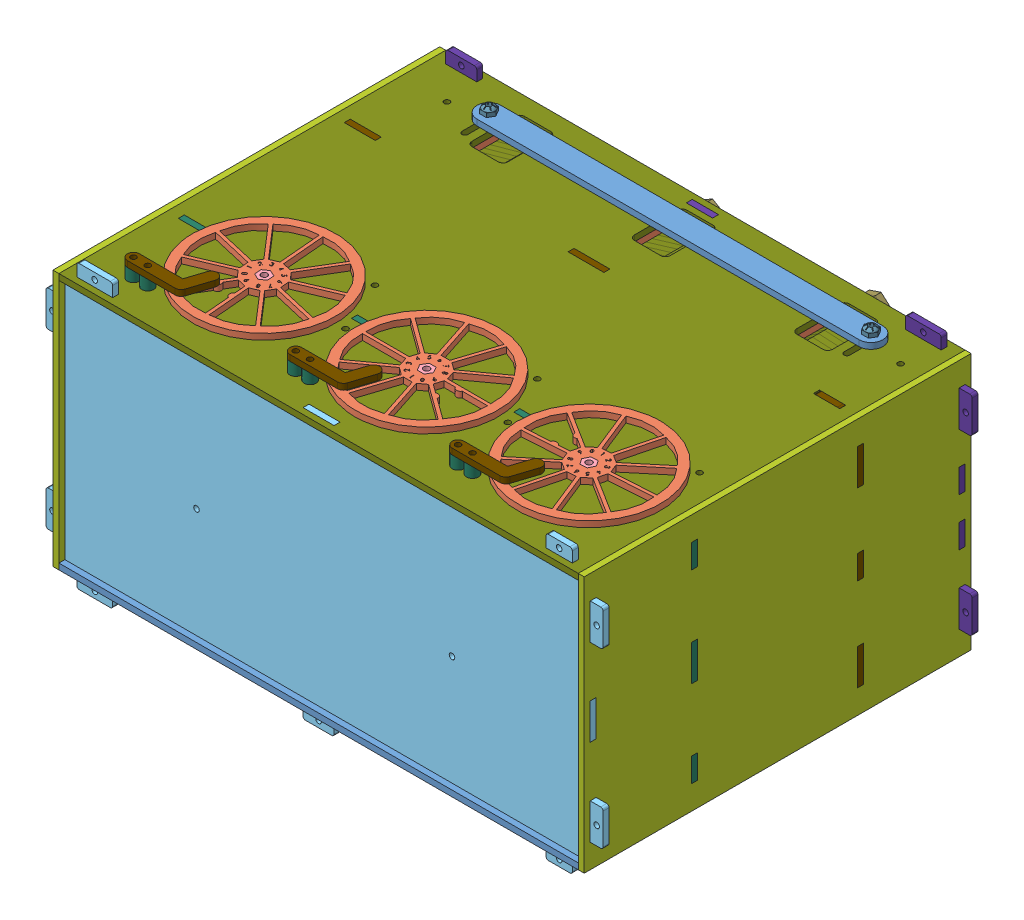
SolidWorks assembly Pascaline.SLDASM, configuration Default (file format 7000). Lengths in mm.
Overall size (316.89 316.89 291.18).
280 component instances, 43 part files, 61 mates.
Components (placement in the parent):
- BottomPanel-1: BottomPanel.SLDPRT [Default] at (-116.7085 3.175 3.175) x (1 0 0) z (0 0 -1) size (276.23 3.17 205.74)
- Input-1: Input.SLDASM [Default] at (-58.2885 162.7052 -47.625) x (0.085321 0 0.996353) z (-0.996353 0 0.085321) size (76.2 73.03 76.2)
  - InputWheel-1: InputWheel.SLDPRT [Default] at (0 -26.1802 0) size (76.2 3.17 76.2)
  - AccumulatorGear-1: AccumulatorGear.SLDPRT [input] at (0 -73.8052 0) size (69.85 3.17 69.85)
  - Standoff-2in-1s4-1: Standoff-2in-1s4.SLDPRT [Default] at (0 -73.8052 0) size (7.33 50.8 6.35)
  - Screw-4-40-1in-1: Screw-4-40-1in.SLDPRT [Default] at (-28.575 -96.0302 9.2846) size (2.84 25.4 2.84)
  - Screw-4-40-1in-2: Screw-4-40-1in.SLDPRT [Default] at (-17.6603 -96.0302 24.3073) size (2.84 25.4 2.84)
  - Screw-4-40-1in-3: Screw-4-40-1in.SLDPRT [Default] at (-28.575 -96.0302 -9.2846) size (2.84 25.4 2.84)
- Accumulator-1: Accumulator.SLDASM [Default] at (-34.3564 65.4099 -52.0636) x (0.406714 -0.913555 0.00082) z (-0.913553 -0.406711 0.002734) size (76.79 111.93 76.84)
  - AccumulatorGear-3: AccumulatorGear.SLDPRT [accum] at (5.3261 -33.8708 28.4877) x (0.104553 -0.002805 0.994515) z (-0.994519 0.00053 0.104555) size (69.85 3.17 69.85)
  - AccumulatorGear-4: AccumulatorGear.SLDPRT [accum] at (5.3078 -56.0957 28.4269) x (0.104553 -0.002805 0.994515) z (-0.994519 0.00053 0.104555) size (69.85 3.17 69.85)
  - Screw-4-40-1in-1: Screw-4-40-1in.SLDPRT [Default] at (-24.534 -8.455 31.6985) x (0.998773 -0.000684 -0.049509) z (-0.049507 0.002771 -0.99877) size (2.84 25.4 2.84)
  - Screw-4-40-1in-2: Screw-4-40-1in.SLDPRT [Default] at (-20.6737 -8.4085 13.5351) x (0.998773 -0.000684 -0.049509) z (-0.049507 0.002771 -0.99877) size (2.84 25.4 2.84)
  - Screw-4-40-1in-3: Screw-4-40-1in.SLDPRT [Default] at (-16.9808 -8.5076 48.662) x (0.998773 -0.000684 -0.049509) z (-0.049507 0.002771 -0.99877) size (2.84 25.4 2.84)
  - Screw-4-40-1in-4: Screw-4-40-1in.SLDPRT [Default] at (-24.5704 -52.9048 31.577) x (0.998773 -0.000684 -0.049509) z (-0.049507 0.002771 -0.99877) size (2.84 25.4 2.84)
  - Screw-4-40-1in-5: Screw-4-40-1in.SLDPRT [Default] at (-17.0381 -78.3573 48.4711) x (-0.902967 0.001916 -0.429705) z (0.429708 0.002116 -0.902965) size (2.84 25.4 2.84)
  - Screw-4-40-1in-6: Screw-4-40-1in.SLDPRT [Default] at (-20.7101 -52.8583 13.4136) x (0.998773 -0.000684 -0.049509) z (-0.049507 0.002771 -0.99877) size (2.84 25.4 2.84)
  - OutputGear-1: OutputGear.SLDPRT [Default] at (5.2689 -103.5935 28.297) x (0.104553 -0.002805 0.994515) z (-0.994519 0.00053 0.104555) size (50.8 3.17 50.8)
  - Standoff-4in-1s4-2: Standoff-4in-1s4.SLDPRT [Default] at (5.2689 -103.5935 28.297) x (0.104553 -0.002805 0.994515) z (-0.994519 0.00053 0.104555) size (7.33 101.6 6.35)
  - Screw-4-40-0p5in-1: Screw-4-40-0p5in.SLDPRT [Default] at (-14.6072 -113.1079 30.3598) x (1 -0.00082 -0.000001) z (-0.000001 -0.002734 0.999996) size (2.84 12.7 2.84)
  - Screw-4-40-0p5in-2: Screw-4-40-0p5in.SLDPRT [Default] at (-9.585 -113.1428 41.6391) x (1 -0.00082 -0.000001) z (-0.000001 -0.002734 0.999996) size (2.84 12.7 2.84)
  - Screw-4-40-0p5in-3: Screw-4-40-0p5in.SLDPRT [Default] at (-12.0405 -113.077 18.2826) x (1 -0.00082 -0.000001) z (-0.000001 -0.002734 0.999996) size (2.84 12.7 2.84)
  - Standoff-p75in-1s4-1: Standoff-p75in-1s4.SLDPRT [Default] at (20.7376 -33.8528 17.29) x (1 -0.00082 -0.000001) z (-0.00082 -0.999996 -0.002734) size (6.35 6.35 19.05)
  - Standoff-p75in-1s4-2: Standoff-p75in-1s4.SLDPRT [Default] at (-12.0772 -33.8353 20.7398) x (0.984615 -0.00033 -0.174737) z (-0.00082 -0.999996 -0.002734) size (6.35 6.35 19.05)
  - OutputGearCap-1: OutputGearCap.SLDPRT [Default] at (5.2663 -106.7685 28.2884) x (0.104553 -0.002805 0.994515) z (-0.994519 0.00053 0.104555) size (21.59 3.17 21.59)
  - Washer-0p38in-1: Washer-0p38in.SLDPRT [Default] at (5.3522 -1.9939 28.5748) x (0.863042 0.000673 -0.505132) z (0.00082 0.999996 0.002734) size (9.65 9.65 0.76)
  - Spacer-stack-8-1: Spacer-stack-8.SLDASM [Default] at (-3.9241 -38.1647 21.5198) x (0.104553 -0.002805 0.994515) z (0.00082 0.999996 0.002734) size (13.2 11.43 25.4)
    - Spacer-hex-1s4-1: Spacer-hex-1s4.SLDPRT [Default] at (7.8847 8.4687 7.4956) size (13.2 11.43 3.17)
    - Spacer-hex-1s4-2: Spacer-hex-1s4.SLDPRT [Default] at (7.8847 8.4687 10.6706) size (13.2 11.43 3.17)
    - Spacer-hex-1s4-3: Spacer-hex-1s4.SLDPRT [Default] at (7.8847 8.4687 13.8456) size (13.2 11.43 3.17)
    - Spacer-hex-1s4-4: Spacer-hex-1s4.SLDPRT [Default] at (7.8847 8.4687 17.0206) size (13.2 11.43 3.17)
    - Spacer-hex-1s4-5: Spacer-hex-1s4.SLDPRT [Default] at (7.8847 8.4687 20.1956) size (13.2 11.43 3.17)
    - Spacer-hex-1s4-6: Spacer-hex-1s4.SLDPRT [Default] at (7.8847 8.4687 23.3706) size (13.2 11.43 3.17)
    - Spacer-hex-1s4-7: Spacer-hex-1s4.SLDPRT [Default] at (7.8847 8.4687 26.5456) size (13.2 11.43 3.17)
    - Spacer-hex-1s4-8: Spacer-hex-1s4.SLDPRT [Default] at (7.8847 8.4687 29.7206) size (13.2 11.43 3.17)
- Readout-1: Readout.SLDASM [Default] at (14.1171 39.2986 -199.7504) x (0.941933 0.3358 0) z (0 0 1) size (85.24 81.6 65.02)
  - Standoff-2p5in-1s4-3: Standoff-2p5in-1s4.SLDPRT [Default] at (-51.5451 71.035 -5.9896) x (0.829038 -0.559193 0) z (-0.559193 -0.829038 0) size (7.33 63.5 6.35)
  - ReadoutGear-1: ReadoutGear.SLDPRT [Default] at (-51.5451 71.035 38.7169) x (0.997564 -0.069756 0) z (0 0 1) size (49.17 51.37 3.17)
  - Spacer-0p25-1s4-4: Spacer-0p25-1s4.SLDPRT [Default] at (-59.1849 67.3088 32.3669) size (6.35 6.35 6.35)
  - Spacer-0p25-1s4-5: Spacer-0p25-1s4.SLDPRT [Default] at (-44.4983 66.2819 32.3669) size (6.35 6.35 6.35)
  - Spacer-0p25-1s4-6: Spacer-0p25-1s4.SLDPRT [Default] at (-50.9522 79.5143 32.3669) size (6.35 6.35 6.35)
  - ReadoutCylinder-1: ReadoutCylinder.SLDPRT [Default] at (-51.5451 71.035 29.1919) x (0.997564 -0.069756 0) z (0 0 1) size (80.12 76.2 3.17)
  - ReadoutCylinder-2: ReadoutCylinder.SLDPRT [Default] at (-51.5451 71.035 26.0169) x (0.997564 -0.069756 0) z (0 0 1) size (80.12 76.2 3.17)
  - ReadoutCylinder-3: ReadoutCylinder.SLDPRT [Default] at (-51.5451 71.035 22.8419) x (0.997564 -0.069756 0) z (0 0 1) size (80.12 76.2 3.17)
  - ReadoutCylinder-4: ReadoutCylinder.SLDPRT [Default] at (-51.5451 71.035 19.6669) x (0.997564 -0.069756 0) z (0 0 1) size (80.12 76.2 3.17)
  - ReadoutCylinder-5: ReadoutCylinder.SLDPRT [Default] at (-51.5451 71.035 16.4919) x (0.997564 -0.069756 0) z (0 0 1) size (80.12 76.2 3.17)
  - ReadoutCylinder-6: ReadoutCylinder.SLDPRT [Default] at (-51.5451 71.035 13.3169) x (0.997564 -0.069756 0) z (0 0 1) size (80.12 76.2 3.17)
  - ReadoutCylinder-7: ReadoutCylinder.SLDPRT [Default] at (-51.5451 71.035 10.1419) x (0.997564 -0.069756 0) z (0 0 1) size (80.12 76.2 3.17)
  - ReadoutCylinder-8: ReadoutCylinder.SLDPRT [Default] at (-51.5451 71.035 6.9669) x (0.997564 -0.069756 0) z (0 0 1) size (80.12 76.2 3.17)
  - Washer-0p38in-1: Washer-0p38in.SLDPRT [Default] at (-51.5451 71.035 57.5104) x (0.999237 0.039047 0) z (0 0 1) size (9.65 9.65 0.76)
  - Washer-0p38in-2: Washer-0p38in.SLDPRT [Default] at (-51.5451 71.035 -6.7516) size (9.65 9.65 0.76)
- Input-2: Input.SLDASM [Default] at (28.0715 162.7052 -47.625) size (76.2 73.03 76.2)
  - InputWheel-1: InputWheel.SLDPRT [Default] at (0 -26.1802 0) size (76.2 3.17 76.2)
  - AccumulatorGear-1: AccumulatorGear.SLDPRT [input] at (0 -73.8052 0) size (69.85 3.17 69.85)
  - Standoff-2in-1s4-1: Standoff-2in-1s4.SLDPRT [Default] at (0 -73.8052 0) size (7.33 50.8 6.35)
  - Screw-4-40-1in-1: Screw-4-40-1in.SLDPRT [Default] at (-28.575 -96.0302 9.2846) size (2.84 25.4 2.84)
  - Screw-4-40-1in-2: Screw-4-40-1in.SLDPRT [Default] at (-17.6603 -96.0302 24.3073) size (2.84 25.4 2.84)
  - Screw-4-40-1in-3: Screw-4-40-1in.SLDPRT [Default] at (-28.575 -96.0302 -9.2846) size (2.84 25.4 2.84)
- Accumulator-2: Accumulator.SLDASM [Default] at (31.6123 77.7559 -52.0636) x (0.953167 -0.302444 0.00082) z (-0.302445 -0.953163 0.002734) size (76.79 111.93 76.84)
  - AccumulatorGear-3: AccumulatorGear.SLDPRT [accum] at (5.3261 -33.8708 28.4877) x (0.104553 -0.002805 0.994515) z (-0.994519 0.00053 0.104555) size (69.85 3.17 69.85)
  - AccumulatorGear-4: AccumulatorGear.SLDPRT [accum] at (5.3078 -56.0957 28.4269) x (0.104553 -0.002805 0.994515) z (-0.994519 0.00053 0.104555) size (69.85 3.17 69.85)
  - Screw-4-40-1in-1: Screw-4-40-1in.SLDPRT [Default] at (-24.534 -8.455 31.6985) x (0.998773 -0.000684 -0.049509) z (-0.049507 0.002771 -0.99877) size (2.84 25.4 2.84)
  - Screw-4-40-1in-2: Screw-4-40-1in.SLDPRT [Default] at (-20.6737 -8.4085 13.5351) x (0.998773 -0.000684 -0.049509) z (-0.049507 0.002771 -0.99877) size (2.84 25.4 2.84)
  - Screw-4-40-1in-3: Screw-4-40-1in.SLDPRT [Default] at (-16.9808 -8.5076 48.662) x (0.998773 -0.000684 -0.049509) z (-0.049507 0.002771 -0.99877) size (2.84 25.4 2.84)
  - Screw-4-40-1in-4: Screw-4-40-1in.SLDPRT [Default] at (-24.5704 -52.9048 31.577) x (0.998773 -0.000684 -0.049509) z (-0.049507 0.002771 -0.99877) size (2.84 25.4 2.84)
  - Screw-4-40-1in-5: Screw-4-40-1in.SLDPRT [Default] at (-17.0381 -78.3573 48.4711) x (-0.902967 0.001916 -0.429705) z (0.429708 0.002116 -0.902965) size (2.84 25.4 2.84)
  - Screw-4-40-1in-6: Screw-4-40-1in.SLDPRT [Default] at (-20.7101 -52.8583 13.4136) x (0.998773 -0.000684 -0.049509) z (-0.049507 0.002771 -0.99877) size (2.84 25.4 2.84)
  - OutputGear-1: OutputGear.SLDPRT [Default] at (5.2689 -103.5935 28.297) x (0.104553 -0.002805 0.994515) z (-0.994519 0.00053 0.104555) size (50.8 3.17 50.8)
  - Standoff-4in-1s4-2: Standoff-4in-1s4.SLDPRT [Default] at (5.2689 -103.5935 28.297) x (0.104553 -0.002805 0.994515) z (-0.994519 0.00053 0.104555) size (7.33 101.6 6.35)
  - Screw-4-40-0p5in-1: Screw-4-40-0p5in.SLDPRT [Default] at (-14.6072 -113.1079 30.3598) x (1 -0.00082 -0.000001) z (-0.000001 -0.002734 0.999996) size (2.84 12.7 2.84)
  - Screw-4-40-0p5in-2: Screw-4-40-0p5in.SLDPRT [Default] at (-9.585 -113.1428 41.6391) x (1 -0.00082 -0.000001) z (-0.000001 -0.002734 0.999996) size (2.84 12.7 2.84)
  - Screw-4-40-0p5in-3: Screw-4-40-0p5in.SLDPRT [Default] at (-12.0405 -113.077 18.2826) x (1 -0.00082 -0.000001) z (-0.000001 -0.002734 0.999996) size (2.84 12.7 2.84)
  - Standoff-p75in-1s4-1: Standoff-p75in-1s4.SLDPRT [Default] at (20.7376 -33.8528 17.29) x (1 -0.00082 -0.000001) z (-0.00082 -0.999996 -0.002734) size (6.35 6.35 19.05)
  - Standoff-p75in-1s4-2: Standoff-p75in-1s4.SLDPRT [Default] at (-12.0772 -33.8353 20.7398) x (0.984615 -0.00033 -0.174737) z (-0.00082 -0.999996 -0.002734) size (6.35 6.35 19.05)
  - OutputGearCap-1: OutputGearCap.SLDPRT [Default] at (5.2663 -106.7685 28.2884) x (0.104553 -0.002805 0.994515) z (-0.994519 0.00053 0.104555) size (21.59 3.17 21.59)
  - Washer-0p38in-1: Washer-0p38in.SLDPRT [Default] at (5.3522 -1.9939 28.5748) x (0.863042 0.000673 -0.505132) z (0.00082 0.999996 0.002734) size (9.65 9.65 0.76)
  - Spacer-stack-8-1: Spacer-stack-8.SLDASM [Default] at (-3.9241 -38.1647 21.5198) x (0.104553 -0.002805 0.994515) z (0.00082 0.999996 0.002734) size (13.2 11.43 25.4)
    - Spacer-hex-1s4-1: Spacer-hex-1s4.SLDPRT [Default] at (7.8847 8.4687 7.4956) size (13.2 11.43 3.17)
    - Spacer-hex-1s4-2: Spacer-hex-1s4.SLDPRT [Default] at (7.8847 8.4687 10.6706) size (13.2 11.43 3.17)
    - Spacer-hex-1s4-3: Spacer-hex-1s4.SLDPRT [Default] at (7.8847 8.4687 13.8456) size (13.2 11.43 3.17)
    - Spacer-hex-1s4-4: Spacer-hex-1s4.SLDPRT [Default] at (7.8847 8.4687 17.0206) size (13.2 11.43 3.17)
    - Spacer-hex-1s4-5: Spacer-hex-1s4.SLDPRT [Default] at (7.8847 8.4687 20.1956) size (13.2 11.43 3.17)
    - Spacer-hex-1s4-6: Spacer-hex-1s4.SLDPRT [Default] at (7.8847 8.4687 23.3706) size (13.2 11.43 3.17)
    - Spacer-hex-1s4-7: Spacer-hex-1s4.SLDPRT [Default] at (7.8847 8.4687 26.5456) size (13.2 11.43 3.17)
    - Spacer-hex-1s4-8: Spacer-hex-1s4.SLDPRT [Default] at (7.8847 8.4687 29.7206) size (13.2 11.43 3.17)
- Readout-2: Readout.SLDASM [Default] at (59.1789 6.8317 -199.7504) x (0.964985 -0.262305 0) z (0 0 1) size (85.24 81.6 65.02)
  - Standoff-2p5in-1s4-3: Standoff-2p5in-1s4.SLDPRT [Default] at (-51.5451 71.035 -5.9896) x (0.829038 -0.559193 0) z (-0.559193 -0.829038 0) size (7.33 63.5 6.35)
  - ReadoutGear-1: ReadoutGear.SLDPRT [Default] at (-51.5451 71.035 38.7169) x (0.997564 -0.069756 0) z (0 0 1) size (49.17 51.37 3.17)
  - Spacer-0p25-1s4-4: Spacer-0p25-1s4.SLDPRT [Default] at (-59.1849 67.3088 32.3669) size (6.35 6.35 6.35)
  - Spacer-0p25-1s4-5: Spacer-0p25-1s4.SLDPRT [Default] at (-44.4983 66.2819 32.3669) size (6.35 6.35 6.35)
  - Spacer-0p25-1s4-6: Spacer-0p25-1s4.SLDPRT [Default] at (-50.9522 79.5143 32.3669) size (6.35 6.35 6.35)
  - ReadoutCylinder-1: ReadoutCylinder.SLDPRT [Default] at (-51.5451 71.035 29.1919) x (0.997564 -0.069756 0) z (0 0 1) size (80.12 76.2 3.17)
  - ReadoutCylinder-2: ReadoutCylinder.SLDPRT [Default] at (-51.5451 71.035 26.0169) x (0.997564 -0.069756 0) z (0 0 1) size (80.12 76.2 3.17)
  - ReadoutCylinder-3: ReadoutCylinder.SLDPRT [Default] at (-51.5451 71.035 22.8419) x (0.997564 -0.069756 0) z (0 0 1) size (80.12 76.2 3.17)
  - ReadoutCylinder-4: ReadoutCylinder.SLDPRT [Default] at (-51.5451 71.035 19.6669) x (0.997564 -0.069756 0) z (0 0 1) size (80.12 76.2 3.17)
  - ReadoutCylinder-5: ReadoutCylinder.SLDPRT [Default] at (-51.5451 71.035 16.4919) x (0.997564 -0.069756 0) z (0 0 1) size (80.12 76.2 3.17)
  - ReadoutCylinder-6: ReadoutCylinder.SLDPRT [Default] at (-51.5451 71.035 13.3169) x (0.997564 -0.069756 0) z (0 0 1) size (80.12 76.2 3.17)
  - ReadoutCylinder-7: ReadoutCylinder.SLDPRT [Default] at (-51.5451 71.035 10.1419) x (0.997564 -0.069756 0) z (0 0 1) size (80.12 76.2 3.17)
  - ReadoutCylinder-8: ReadoutCylinder.SLDPRT [Default] at (-51.5451 71.035 6.9669) x (0.997564 -0.069756 0) z (0 0 1) size (80.12 76.2 3.17)
  - Washer-0p38in-1: Washer-0p38in.SLDPRT [Default] at (-51.5451 71.035 57.5104) x (0.999237 0.039047 0) z (0 0 1) size (9.65 9.65 0.76)
  - Washer-0p38in-2: Washer-0p38in.SLDPRT [Default] at (-51.5451 71.035 -6.7516) size (9.65 9.65 0.76)
- Input-3: Input.SLDASM [Default] at (114.4315 162.7052 -47.625) x (-0.997759 0 0.066903) z (-0.066903 0 -0.997759) size (76.2 73.03 76.2)
  - InputWheel-1: InputWheel.SLDPRT [Default] at (0 -26.1802 0) size (76.2 3.17 76.2)
  - AccumulatorGear-1: AccumulatorGear.SLDPRT [input] at (0 -73.8052 0) size (69.85 3.17 69.85)
  - Standoff-2in-1s4-1: Standoff-2in-1s4.SLDPRT [Default] at (0 -73.8052 0) size (7.33 50.8 6.35)
  - Screw-4-40-1in-1: Screw-4-40-1in.SLDPRT [Default] at (-28.575 -96.0302 9.2846) size (2.84 25.4 2.84)
  - Screw-4-40-1in-2: Screw-4-40-1in.SLDPRT [Default] at (-17.6603 -96.0302 24.3073) size (2.84 25.4 2.84)
  - Screw-4-40-1in-3: Screw-4-40-1in.SLDPRT [Default] at (-28.575 -96.0302 -9.2846) size (2.84 25.4 2.84)
- Accumulator-4: Accumulator.SLDASM [Default] at (87.2292 38.6226 -52.0636) x (-0.17499 0.98457 0.00082) z (0.984567 0.174988 0.002734) size (76.79 111.93 76.84)
  - AccumulatorGear-3: AccumulatorGear.SLDPRT [accum] at (5.3261 -33.8708 28.4877) x (0.104553 -0.002805 0.994515) z (-0.994519 0.00053 0.104555) size (69.85 3.17 69.85)
  - AccumulatorGear-4: AccumulatorGear.SLDPRT [accum] at (5.3078 -56.0957 28.4269) x (0.104553 -0.002805 0.994515) z (-0.994519 0.00053 0.104555) size (69.85 3.17 69.85)
  - Screw-4-40-1in-1: Screw-4-40-1in.SLDPRT [Default] at (-24.534 -8.455 31.6985) x (0.998773 -0.000684 -0.049509) z (-0.049507 0.002771 -0.99877) size (2.84 25.4 2.84)
  - Screw-4-40-1in-2: Screw-4-40-1in.SLDPRT [Default] at (-20.6737 -8.4085 13.5351) x (0.998773 -0.000684 -0.049509) z (-0.049507 0.002771 -0.99877) size (2.84 25.4 2.84)
  - Screw-4-40-1in-3: Screw-4-40-1in.SLDPRT [Default] at (-16.9808 -8.5076 48.662) x (0.998773 -0.000684 -0.049509) z (-0.049507 0.002771 -0.99877) size (2.84 25.4 2.84)
  - Screw-4-40-1in-4: Screw-4-40-1in.SLDPRT [Default] at (-24.5704 -52.9048 31.577) x (0.998773 -0.000684 -0.049509) z (-0.049507 0.002771 -0.99877) size (2.84 25.4 2.84)
  - Screw-4-40-1in-5: Screw-4-40-1in.SLDPRT [Default] at (-17.0381 -78.3573 48.4711) x (-0.902967 0.001916 -0.429705) z (0.429708 0.002116 -0.902965) size (2.84 25.4 2.84)
  - Screw-4-40-1in-6: Screw-4-40-1in.SLDPRT [Default] at (-20.7101 -52.8583 13.4136) x (0.998773 -0.000684 -0.049509) z (-0.049507 0.002771 -0.99877) size (2.84 25.4 2.84)
  - OutputGear-1: OutputGear.SLDPRT [Default] at (5.2689 -103.5935 28.297) x (0.104553 -0.002805 0.994515) z (-0.994519 0.00053 0.104555) size (50.8 3.17 50.8)
  - Standoff-4in-1s4-2: Standoff-4in-1s4.SLDPRT [Default] at (5.2689 -103.5935 28.297) x (0.104553 -0.002805 0.994515) z (-0.994519 0.00053 0.104555) size (7.33 101.6 6.35)
  - Screw-4-40-0p5in-1: Screw-4-40-0p5in.SLDPRT [Default] at (-14.6072 -113.1079 30.3598) x (1 -0.00082 -0.000001) z (-0.000001 -0.002734 0.999996) size (2.84 12.7 2.84)
  - Screw-4-40-0p5in-2: Screw-4-40-0p5in.SLDPRT [Default] at (-9.585 -113.1428 41.6391) x (1 -0.00082 -0.000001) z (-0.000001 -0.002734 0.999996) size (2.84 12.7 2.84)
  - Screw-4-40-0p5in-3: Screw-4-40-0p5in.SLDPRT [Default] at (-12.0405 -113.077 18.2826) x (1 -0.00082 -0.000001) z (-0.000001 -0.002734 0.999996) size (2.84 12.7 2.84)
  - Standoff-p75in-1s4-1: Standoff-p75in-1s4.SLDPRT [Default] at (20.7376 -33.8528 17.29) x (1 -0.00082 -0.000001) z (-0.00082 -0.999996 -0.002734) size (6.35 6.35 19.05)
  - Standoff-p75in-1s4-2: Standoff-p75in-1s4.SLDPRT [Default] at (-12.0772 -33.8353 20.7398) x (0.984615 -0.00033 -0.174737) z (-0.00082 -0.999996 -0.002734) size (6.35 6.35 19.05)
  - OutputGearCap-1: OutputGearCap.SLDPRT [Default] at (5.2663 -106.7685 28.2884) x (0.104553 -0.002805 0.994515) z (-0.994519 0.00053 0.104555) size (21.59 3.17 21.59)
  - Washer-0p38in-1: Washer-0p38in.SLDPRT [Default] at (5.3522 -1.9939 28.5748) x (0.863042 0.000673 -0.505132) z (0.00082 0.999996 0.002734) size (9.65 9.65 0.76)
  - Spacer-stack-8-1: Spacer-stack-8.SLDASM [Default] at (-3.9241 -38.1647 21.5198) x (0.104553 -0.002805 0.994515) z (0.00082 0.999996 0.002734) size (13.2 11.43 25.4)
    - Spacer-hex-1s4-1: Spacer-hex-1s4.SLDPRT [Default] at (7.8847 8.4687 7.4956) size (13.2 11.43 3.17)
    - Spacer-hex-1s4-2: Spacer-hex-1s4.SLDPRT [Default] at (7.8847 8.4687 10.6706) size (13.2 11.43 3.17)
    - Spacer-hex-1s4-3: Spacer-hex-1s4.SLDPRT [Default] at (7.8847 8.4687 13.8456) size (13.2 11.43 3.17)
    - Spacer-hex-1s4-4: Spacer-hex-1s4.SLDPRT [Default] at (7.8847 8.4687 17.0206) size (13.2 11.43 3.17)
    - Spacer-hex-1s4-5: Spacer-hex-1s4.SLDPRT [Default] at (7.8847 8.4687 20.1956) size (13.2 11.43 3.17)
    - Spacer-hex-1s4-6: Spacer-hex-1s4.SLDPRT [Default] at (7.8847 8.4687 23.3706) size (13.2 11.43 3.17)
    - Spacer-hex-1s4-7: Spacer-hex-1s4.SLDPRT [Default] at (7.8847 8.4687 26.5456) size (13.2 11.43 3.17)
    - Spacer-hex-1s4-8: Spacer-hex-1s4.SLDPRT [Default] at (7.8847 8.4687 29.7206) size (13.2 11.43 3.17)
- Readout-3: Readout.SLDASM [Default] at (167.2561 18.8113 -199.7504) x (0.999836 0.018131 0) z (0 0 1) size (85.24 81.6 65.02)
  - Standoff-2p5in-1s4-3: Standoff-2p5in-1s4.SLDPRT [Default] at (-51.5451 71.035 -5.9896) x (0.829038 -0.559193 0) z (-0.559193 -0.829038 0) size (7.33 63.5 6.35)
  - ReadoutGear-1: ReadoutGear.SLDPRT [Default] at (-51.5451 71.035 38.7169) x (0.997564 -0.069756 0) z (0 0 1) size (49.17 51.37 3.17)
  - Spacer-0p25-1s4-4: Spacer-0p25-1s4.SLDPRT [Default] at (-59.1849 67.3088 32.3669) size (6.35 6.35 6.35)
  - Spacer-0p25-1s4-5: Spacer-0p25-1s4.SLDPRT [Default] at (-44.4983 66.2819 32.3669) size (6.35 6.35 6.35)
  - Spacer-0p25-1s4-6: Spacer-0p25-1s4.SLDPRT [Default] at (-50.9522 79.5143 32.3669) size (6.35 6.35 6.35)
  - ReadoutCylinder-1: ReadoutCylinder.SLDPRT [Default] at (-51.5451 71.035 29.1919) x (0.997564 -0.069756 0) z (0 0 1) size (80.12 76.2 3.17)
  - ReadoutCylinder-2: ReadoutCylinder.SLDPRT [Default] at (-51.5451 71.035 26.0169) x (0.997564 -0.069756 0) z (0 0 1) size (80.12 76.2 3.17)
  - ReadoutCylinder-3: ReadoutCylinder.SLDPRT [Default] at (-51.5451 71.035 22.8419) x (0.997564 -0.069756 0) z (0 0 1) size (80.12 76.2 3.17)
  - ReadoutCylinder-4: ReadoutCylinder.SLDPRT [Default] at (-51.5451 71.035 19.6669) x (0.997564 -0.069756 0) z (0 0 1) size (80.12 76.2 3.17)
  - ReadoutCylinder-5: ReadoutCylinder.SLDPRT [Default] at (-51.5451 71.035 16.4919) x (0.997564 -0.069756 0) z (0 0 1) size (80.12 76.2 3.17)
  - ReadoutCylinder-6: ReadoutCylinder.SLDPRT [Default] at (-51.5451 71.035 13.3169) x (0.997564 -0.069756 0) z (0 0 1) size (80.12 76.2 3.17)
  - ReadoutCylinder-7: ReadoutCylinder.SLDPRT [Default] at (-51.5451 71.035 10.1419) x (0.997564 -0.069756 0) z (0 0 1) size (80.12 76.2 3.17)
  - ReadoutCylinder-8: ReadoutCylinder.SLDPRT [Default] at (-51.5451 71.035 6.9669) x (0.997564 -0.069756 0) z (0 0 1) size (80.12 76.2 3.17)
  - Washer-0p38in-1: Washer-0p38in.SLDPRT [Default] at (-51.5451 71.035 57.5104) x (0.999237 0.039047 0) z (0 0 1) size (9.65 9.65 0.76)
  - Washer-0p38in-2: Washer-0p38in.SLDPRT [Default] at (-51.5451 71.035 -6.7516) size (9.65 9.65 0.76)
- BackPanel-1: BackPanel.SLDPRT [Default] at (-116.7085 3.175 -199.39) size (296.29 150.24 3.18)
- Ratchets-1: Ratchets.SLDASM [Default] at (-81.708 -156.4494 -388.6538) x (0.938568 0.345094 0) z (0 0 1) size (314.7 232.09 30.1)
  - MidPanel2-1: MidPanel2.SLDPRT [Default] at (22.2351 161.8968 243.2388) x (0.938568 -0.345094 0) z (0 0 1) size (282.58 143.38 3.18)
  - Standoff-0p75in-1s4-2: Standoff-0p75in-1s4.SLDPRT [Default] at (71.4078 258.8325 265.4638) x (-0.999902 -0.013974 0) z (0.013974 -0.999902 0) size (7.33 19.05 6.35)
  - Washer-0p38in-4: Washer-0p38in.SLDPRT [Default] at (71.4078 258.8325 265.4638) x (0.886945 0.461875 0) z (0 0 1) size (9.65 9.65 0.76)
  - Spacer-0p25-1s4-1: Spacer-0p25-1s4.SLDPRT [Default] at (71.4078 258.8325 266.2258) x (0.918268 0.39596 0) z (0 0 1) size (6.35 6.35 6.35)
  - Washer-0p38in-1: Washer-0p38in.SLDPRT [Default] at (71.4078 258.8325 272.5758) x (0.974797 -0.223092 0) z (0 0 1) size (9.65 9.65 0.76)
  - Standoff-0p75in-1s4-1: Standoff-0p75in-1s4.SLDPRT [Default] at (152.4626 229.0302 265.4638) x (-0.830154 -0.557534 0) z (0.557534 -0.830154 0) size (7.33 19.05 6.35)
  - Washer-0p38in-5: Washer-0p38in.SLDPRT [Default] at (152.4626 229.0302 265.4638) x (0.971362 -0.237603 0) z (0 0 1) size (9.65 9.65 0.76)
  - Spacer-0p25-1s4-2: Spacer-0p25-1s4.SLDPRT [Default] at (152.4626 229.0302 266.2258) x (0.998153 0.060744 0) z (0 0 1) size (6.35 6.35 6.35)
  - Washer-0p38in-2: Washer-0p38in.SLDPRT [Default] at (152.4626 229.0302 272.5758) x (0.964442 -0.264293 0) z (0 0 1) size (9.65 9.65 0.76)
  - Standoff-0p75in-1s4-3: Standoff-0p75in-1s4.SLDPRT [Default] at (233.5173 199.2278 265.4638) x (0.732123 -0.681172 0) z (0.681172 0.732123 0) size (7.33 19.05 6.35)
  - Washer-0p38in-6: Washer-0p38in.SLDPRT [Default] at (233.5173 199.2278 265.4638) x (0.998962 0.045555 0) z (0 0 1) size (9.65 9.65 0.76)
  - Spacer-0p25-1s4-3: Spacer-0p25-1s4.SLDPRT [Default] at (233.5173 199.2278 266.2258) x (-0.1226 0.992456 0) z (0 0 1) size (6.35 6.35 6.35)
  - Washer-0p38in-3: Washer-0p38in.SLDPRT [Default] at (233.5173 199.2278 272.5758) x (0.76285 -0.646575 0) z (0 0 1) size (9.65 9.65 0.76)
  - Standoff-round-0p25in-1s4-3: Standoff-round-0p25in-1s4.SLDPRT [Default] at (133.7739 148.7604 246.4138) x (-0.853855 0.520511 0) z (0 0 1) size (6.35 6.35 6.35)
  - Standoff-round-0p25in-1s4-4: Standoff-round-0p25in-1s4.SLDPRT [Default] at (214.8286 118.958 246.4138) x (-0.853855 0.520511 0) z (0 0 1) size (6.35 6.35 6.35)
  - SautoirBacking-2: SautoirBacking.SLDPRT [Default] at (77.1723 171.4661 252.7638) x (0.938568 -0.345094 0) z (0 0 1) size (20.32 35.56 3.17)
  - Spacer-0p25-1s4-4: Spacer-0p25-1s4.SLDPRT [Default] at (97.8841 198.3555 246.4138) size (6.35 6.35 6.35)
  - Spacer-0p25-1s4-5: Spacer-0p25-1s4.SLDPRT [Default] at (87.8039 170.9399 246.4138) size (6.35 6.35 6.35)
  - SautoirBacking-3: SautoirBacking.SLDPRT [Default] at (158.2271 141.6638 252.7638) x (0.938568 -0.345094 0) z (0 0 1) size (20.32 35.56 3.17)
  - Spacer-0p25-1s4-6: Spacer-0p25-1s4.SLDPRT [Default] at (168.8586 141.1376 246.4138) size (6.35 6.35 6.35)
  - Spacer-0p25-1s4-7: Spacer-0p25-1s4.SLDPRT [Default] at (178.9388 168.5531 246.4138) x (-0.849972 -0.526827 0) z (0 0 1) size (6.35 6.35 6.35)
- Backstop-1: Backstop.SLDASM [Default] at (-120.8445 61.946 -194.8362) x (0.991787 -0.127902 0) z (0 0 1) size (69.7 32.28 14.68)
  - BackstopPawl-1: BackstopPawl.SLDPRT [Default] at (4.0576 45.8485 75.5832) size (69.7 32.28 3.18)
  - BackstopPawl-2: BackstopPawl.SLDPRT [Default] at (4.0576 45.8485 72.4082) size (69.7 32.28 3.18)
  - Nut-3s8-1: Nut-3s8.SLDPRT [Default] at (57.7688 59.5119 70.4238) x (0 0 1) z (0 -1 0) size (8.33 14.29 16.5)
  - BackstopCap-1: BackstopCap.SLDPRT [Default] at (57.7688 59.5119 67.2488) x (0.989802 0.142448 0) z (0 0 1) size (15.88 15.88 3.17)
  - BackstopCap-2: BackstopCap.SLDPRT [Default] at (57.7688 59.5119 78.7582) x (0.999963 -0.008552 0) z (0 0 1) size (15.88 15.88 3.17)
- Backstop-2: Backstop.SLDASM [Default] at (-36.6112 62.7262 -194.8362) x (0.985272 -0.170992 0) z (0 0 1) size (69.7 32.28 14.68)
  - BackstopPawl-1: BackstopPawl.SLDPRT [Default] at (4.0576 45.8485 75.5832) size (69.7 32.28 3.18)
  - BackstopPawl-2: BackstopPawl.SLDPRT [Default] at (4.0576 45.8485 72.4082) size (69.7 32.28 3.18)
  - Nut-3s8-1: Nut-3s8.SLDPRT [Default] at (57.7688 59.5119 70.4238) x (0 0 1) z (0 -1 0) size (8.33 14.29 16.5)
  - BackstopCap-1: BackstopCap.SLDPRT [Default] at (57.7688 59.5119 67.2488) x (0.989802 0.142448 0) z (0 0 1) size (15.88 15.88 3.17)
  - BackstopCap-2: BackstopCap.SLDPRT [Default] at (57.7688 59.5119 78.7582) x (0.999963 -0.008552 0) z (0 0 1) size (15.88 15.88 3.17)
- Backstop-3: Backstop.SLDASM [Default] at (58.3057 60.1962 -194.8362) x (1 0.000036 0) z (0 0 1) size (69.7 32.28 14.68)
  - BackstopPawl-1: BackstopPawl.SLDPRT [Default] at (4.0576 45.8485 75.5832) size (69.7 32.28 3.18)
  - BackstopPawl-2: BackstopPawl.SLDPRT [Default] at (4.0576 45.8485 72.4082) size (69.7 32.28 3.18)
  - Nut-3s8-1: Nut-3s8.SLDPRT [Default] at (57.7688 59.5119 70.4238) x (0 0 1) z (0 -1 0) size (8.33 14.29 16.5)
  - BackstopCap-1: BackstopCap.SLDPRT [Default] at (57.7688 59.5119 67.2488) x (0.989802 0.142448 0) z (0 0 1) size (15.88 15.88 3.17)
  - BackstopCap-2: BackstopCap.SLDPRT [Default] at (57.7688 59.5119 78.7582) x (0.999963 -0.008552 0) z (0 0 1) size (15.88 15.88 3.17)
- Sautoir-1: Sautoir.SLDASM [Default] at (8.3175 62.3193 -154.4839) x (0 0 1) z (-0.834496 -0.551013 0) size (60.33 90.66 88.9)
  - SautoirMount-1: SautoirMount.SLDPRT [SautoirMountA] at (12.2439 19.1483 75.6794) size (3.17 12.7 68.58)
  - SautoirMount-2: SautoirMount.SLDPRT [SautoirMountB] at (15.4189 19.1483 75.6794) size (3.17 12.7 68.58)
  - SautoirMountC-1: SautoirMountC.SLDPRT [Default] at (18.5939 19.1483 30.1032) x (0 0 1) z (-1 0 0) size (21.39 21.71 3.17)
  - SautoirMountC-2: SautoirMountC.SLDPRT [Default] at (21.7689 19.1483 30.1032) x (0 0 1) z (-1 0 0) size (21.39 21.71 3.17)
  - Standoff-1p75in-1s4-1: Standoff-1p75in-1s4.SLDPRT [Default] at (59.8689 25.4983 19.7994) x (0 0.866025 0.5) z (0 -0.5 0.866025) size (7.33 44.45 6.35)
  - SautoirArm-1: SautoirArm.SLDPRT [Default] at (24.9439 6.4483 26.1494) x (0 0 -1) z (1 0 0) size (16.31 38.1 3.17)
  - SautoirArm-2: SautoirArm.SLDPRT [Default] at (34.4689 6.4483 26.1494) x (0 0 -1) z (1 0 0) size (16.31 38.1 3.17)
  - CarryPawl-4: CarryPawl.SLDPRT [Default] at (28.1189 -15.4018 39.1312) x (0 0.033579 -0.999436) z (1 0 0) size (55.75 22.21 3.05)
  - CarryPawl-3: CarryPawl.SLDPRT [Default] at (31.1669 -15.4018 39.1312) x (0 0.033579 -0.999436) z (1 0 0) size (55.75 22.21 3.05)
  - CarryLever-2: CarryLever.SLDPRT [Default] at (59.8689 19.7833 26.1494) x (0 0 -1) z (1 0 0) size (42.55 86.89 3.17)
  - CarryLever-3: CarryLever.SLDPRT [Default] at (63.0439 19.7833 26.1494) x (0 0 -1) z (1 0 0) size (42.55 86.89 3.17)
  - SautoirMountC-3: SautoirMountC.SLDPRT [Default] at (56.6939 19.1483 30.1032) x (0 0 1) z (-1 0 0) size (21.39 21.71 3.17)
  - Spacer-0p25-1s4-1: Spacer-0p25-1s4.SLDPRT [Default] at (28.1189 38.1983 19.7994) x (0 0 -1) z (1 0 0) size (6.35 6.35 6.35)
  - Bolt-3s8-0p625-1: Bolt-3s8-0p625.SLDPRT [Default] at (66.2189 71.4105 12.5909) x (1 0 0) z (0 -0.672316 0.740264) size (22.23 14.29 16.5)
  - Nut-3s8-1: Nut-3s8.SLDPRT [Default] at (51.5345 71.4105 12.5909) x (1 0 0) z (0 -0.672316 0.740264) size (8.33 14.29 16.5)
  - Locknut-1: Locknut.SLDPRT [Default] at (39.7648 12.7983 19.7994) x (0 0 1) z (-1 0 0) size (7.33 6.35 3.56)
- Sautoir-2: Sautoir.SLDASM [Default] at (94.5342 34.7783 -154.4839) x (0 0 1) z (-0.984656 -0.174507 0) size (60.33 90.66 88.9)
  - SautoirMount-1: SautoirMount.SLDPRT [SautoirMountA] at (12.2439 19.1483 75.6794) size (3.17 12.7 68.58)
  - SautoirMount-2: SautoirMount.SLDPRT [SautoirMountB] at (15.4189 19.1483 75.6794) size (3.17 12.7 68.58)
  - SautoirMountC-1: SautoirMountC.SLDPRT [Default] at (18.5939 19.1483 30.1032) x (0 0 1) z (-1 0 0) size (21.39 21.71 3.17)
  - SautoirMountC-2: SautoirMountC.SLDPRT [Default] at (21.7689 19.1483 30.1032) x (0 0 1) z (-1 0 0) size (21.39 21.71 3.17)
  - Standoff-1p75in-1s4-1: Standoff-1p75in-1s4.SLDPRT [Default] at (59.8689 25.4983 19.7994) x (0 0.866025 0.5) z (0 -0.5 0.866025) size (7.33 44.45 6.35)
  - SautoirArm-1: SautoirArm.SLDPRT [Default] at (24.9439 6.4483 26.1494) x (0 0 -1) z (1 0 0) size (16.31 38.1 3.17)
  - SautoirArm-2: SautoirArm.SLDPRT [Default] at (34.4689 6.4483 26.1494) x (0 0 -1) z (1 0 0) size (16.31 38.1 3.17)
  - CarryPawl-4: CarryPawl.SLDPRT [Default] at (28.1189 -15.4018 39.1312) x (0 0.033579 -0.999436) z (1 0 0) size (55.75 22.21 3.05)
  - CarryPawl-3: CarryPawl.SLDPRT [Default] at (31.1669 -15.4018 39.1312) x (0 0.033579 -0.999436) z (1 0 0) size (55.75 22.21 3.05)
  - CarryLever-2: CarryLever.SLDPRT [Default] at (59.8689 19.7833 26.1494) x (0 0 -1) z (1 0 0) size (42.55 86.89 3.17)
  - CarryLever-3: CarryLever.SLDPRT [Default] at (63.0439 19.7833 26.1494) x (0 0 -1) z (1 0 0) size (42.55 86.89 3.17)
  - SautoirMountC-3: SautoirMountC.SLDPRT [Default] at (56.6939 19.1483 30.1032) x (0 0 1) z (-1 0 0) size (21.39 21.71 3.17)
  - Spacer-0p25-1s4-1: Spacer-0p25-1s4.SLDPRT [Default] at (28.1189 38.1983 19.7994) x (0 0 -1) z (1 0 0) size (6.35 6.35 6.35)
  - Bolt-3s8-0p625-1: Bolt-3s8-0p625.SLDPRT [Default] at (66.2189 71.4105 12.5909) x (1 0 0) z (0 -0.672316 0.740264) size (22.23 14.29 16.5)
  - Nut-3s8-1: Nut-3s8.SLDPRT [Default] at (51.5345 71.4105 12.5909) x (1 0 0) z (0 -0.672316 0.740264) size (8.33 14.29 16.5)
  - Locknut-1: Locknut.SLDPRT [Default] at (39.7648 12.7983 19.7994) x (0 0 1) z (-1 0 0) size (7.33 6.35 3.56)
- MidPanel1-1: MidPanel1.SLDPRT [Default] at (-116.7085 3.175 -57.15) size (282.58 143.38 3.18)
- TopAssembly-2: TopAssembly.SLDASM [Default] at (-100.0552 -8.4514 -297.0961) size (276.23 41.27 205.74)
  - TopPanel-1: TopPanel.SLDPRT [Default] at (-16.6534 141.8014 300.2711) size (276.23 3.17 205.74)
  - InputBacking-1: InputBacking.SLDPRT [Default] at (41.7666 138.6264 249.4711) size (81.07 3.17 76.2)
  - Spacer-0p25-1s4-1: Spacer-0p25-1s4.SLDPRT [Default] at (12.7674 151.3264 282.4432) x (0.646996 0 -0.762494) z (0 -1 0) size (6.35 6.35 6.35)
  - Spacer-0p25-1s4-2: Spacer-0p25-1s4.SLDPRT [Default] at (5.1474 151.3264 282.4432) x (0.139598 0 -0.990208) z (0 -1 0) size (6.35 6.35 6.35)
  - FingerStop-1: FingerStop.SLDPRT [Default] at (5.1474 151.3264 282.4432) size (35.67 3.17 18.43)
  - InputBacking-2: InputBacking.SLDPRT [Default] at (128.1266 138.6264 249.4711) size (81.07 3.17 76.2)
  - Spacer-0p25-1s4-3: Spacer-0p25-1s4.SLDPRT [Default] at (91.5074 151.3264 282.4432) x (0.999262 0 0.038412) z (0 -1 0) size (6.35 6.35 6.35)
  - Spacer-0p25-1s4-4: Spacer-0p25-1s4.SLDPRT [Default] at (99.1274 151.3264 282.4432) x (0.62391 0 0.781496) z (0 -1 0) size (6.35 6.35 6.35)
  - FingerStop-3: FingerStop.SLDPRT [Default] at (91.5074 151.3264 282.4432) size (35.67 3.17 18.43)
  - InputBacking-3: InputBacking.SLDPRT [Default] at (214.4866 138.6264 249.4711) size (81.07 3.17 76.2)
  - Spacer-0p25-1s4-5: Spacer-0p25-1s4.SLDPRT [Default] at (185.4874 151.3264 282.4432) x (0.993795 0 0.111224) z (0 -1 0) size (6.35 6.35 6.35)
  - Spacer-0p25-1s4-6: Spacer-0p25-1s4.SLDPRT [Default] at (177.8674 151.3264 282.4432) x (0.413398 0 0.91055) z (0 -1 0) size (6.35 6.35 6.35)
  - FingerStop-4: FingerStop.SLDPRT [Default] at (177.8674 151.3264 282.4432) size (35.67 3.17 18.43)
  - ReadoutCover-1: ReadoutCover.SLDPRT [Default] at (26.5774 144.9764 114.7787) size (215.9 3.17 12.7)
  - Locknut-1: Locknut.SLDPRT [Default] at (26.5774 150.2723 114.7787) x (1 0 0) z (0 -1 0) size (7.33 6.35 3.56)
  - Locknut-2: Locknut.SLDPRT [Default] at (229.7774 150.2723 114.7787) x (1 0 0) z (0 -1 0) size (7.33 6.35 3.56)
  - ReadoutShield-1: ReadoutShield.SLDPRT [Default] at (1.1266 138.6264 133.2661) size (254 3.17 30.48)
  - InputBrace-1: InputBrace.SLDPRT [Default] at (36.0516 113.2264 249.4711) size (196.85 3.17 12.7)
  - Standoff-1in-1s4-1: Standoff-1in-1s4.SLDPRT [Default] at (171.3066 141.8014 249.4711) x (1 0 0) z (0 -1 0) size (6.35 6.35 25.4)
  - Standoff-1in-1s4-2: Standoff-1in-1s4.SLDPRT [Default] at (84.9466 141.8014 249.4711) x (-0.986882 0 0.161445) z (0 -1 0) size (6.35 6.35 25.4)
- FrontAssembly-1: FrontAssembly.SLDASM [Default] at (-117.4883 -71.9112 -225.649) size (296.29 150.24 6.35)
  - FrontPanel-1: FrontPanel.SLDPRT [Default] at (0.7798 75.0862 222.474) size (296.29 150.24 3.18)
  - FrontColorPlate-1: FrontColorPlate.SLDPRT [Default] at (65.7137 104.9312 219.299) size (146.05 57.15 3.17)
- SidePanel-1: SidePanel.SLDPRT [Default] at (-116.7085 0 -202.565) x (-1 0 0) z (0 0 -1) size (3.17 136.53 205.74)
- SidePanel-2: SidePanel.SLDPRT [Default] at (162.6915 0 -202.565) x (-1 0 0) z (0 0 -1) size (3.17 136.53 205.74)
- Spacer-stack-7-1: Spacer-stack-7.SLDASM [Default] at (-60.8826 37.6185 -293.5439) x (0.866025 0.5 0) z (0 0 1) size (13.2 11.43 22.23)
  - Spacer-hex-1s4-1: Spacer-hex-1s4.SLDPRT [Default] at (7.8847 8.4687 7.4956) size (13.2 11.43 3.17)
  - Spacer-hex-1s4-2: Spacer-hex-1s4.SLDPRT [Default] at (7.8847 8.4687 10.6706) size (13.2 11.43 3.17)
  - Spacer-hex-1s4-3: Spacer-hex-1s4.SLDPRT [Default] at (7.8847 8.4687 13.8456) size (13.2 11.43 3.17)
  - Spacer-hex-1s4-4: Spacer-hex-1s4.SLDPRT [Default] at (7.8847 8.4687 17.0206) size (13.2 11.43 3.17)
  - Spacer-hex-1s4-5: Spacer-hex-1s4.SLDPRT [Default] at (7.8847 8.4687 20.1956) size (13.2 11.43 3.17)
  - Spacer-hex-1s4-6: Spacer-hex-1s4.SLDPRT [Default] at (7.8847 8.4687 23.3706) size (13.2 11.43 3.17)
  - Spacer-hex-1s4-7: Spacer-hex-1s4.SLDPRT [Default] at (7.8847 8.4687 26.5456) size (13.2 11.43 3.17)
- Spacer-stack-7-2: Spacer-stack-7.SLDASM [Default] at (23.2624 38.3707 -295.4996) x (0.948893 0.315599 0) z (0 0 1) size (13.2 11.43 22.23)
  - Spacer-hex-1s4-1: Spacer-hex-1s4.SLDPRT [Default] at (7.8847 8.4687 7.4956) size (13.2 11.43 3.17)
  - Spacer-hex-1s4-2: Spacer-hex-1s4.SLDPRT [Default] at (7.8847 8.4687 10.6706) size (13.2 11.43 3.17)
  - Spacer-hex-1s4-3: Spacer-hex-1s4.SLDPRT [Default] at (7.8847 8.4687 13.8456) size (13.2 11.43 3.17)
  - Spacer-hex-1s4-4: Spacer-hex-1s4.SLDPRT [Default] at (7.8847 8.4687 17.0206) size (13.2 11.43 3.17)
  - Spacer-hex-1s4-5: Spacer-hex-1s4.SLDPRT [Default] at (7.8847 8.4687 20.1956) size (13.2 11.43 3.17)
  - Spacer-hex-1s4-6: Spacer-hex-1s4.SLDPRT [Default] at (7.8847 8.4687 23.3706) size (13.2 11.43 3.17)
  - Spacer-hex-1s4-7: Spacer-hex-1s4.SLDPRT [Default] at (7.8847 8.4687 26.5456) size (13.2 11.43 3.17)
- Spacer-stack-10-2: Spacer-stack-10.SLDASM [Default] at (109.2008 38.5738 -147.3226) x (0.960878 0.276971 0) z (0 0 1) size (13.2 11.43 31.75)
  - Spacer-hex-1s4-1: Spacer-hex-1s4.SLDPRT [Default] at (7.8847 8.4687 7.4956) size (13.2 11.43 3.17)
  - Spacer-hex-1s4-2: Spacer-hex-1s4.SLDPRT [Default] at (7.8847 8.4687 10.6706) size (13.2 11.43 3.17)
  - Spacer-hex-1s4-3: Spacer-hex-1s4.SLDPRT [Default] at (7.8847 8.4687 13.8456) size (13.2 11.43 3.17)
  - Spacer-hex-1s4-4: Spacer-hex-1s4.SLDPRT [Default] at (7.8847 8.4687 17.0206) size (13.2 11.43 3.17)
  - Spacer-hex-1s4-5: Spacer-hex-1s4.SLDPRT [Default] at (7.8847 8.4687 20.1956) size (13.2 11.43 3.17)
  - Spacer-hex-1s4-6: Spacer-hex-1s4.SLDPRT [Default] at (7.8847 8.4687 23.3706) size (13.2 11.43 3.17)
  - Spacer-hex-1s4-7: Spacer-hex-1s4.SLDPRT [Default] at (7.8847 8.4687 26.5456) size (13.2 11.43 3.17)
  - Spacer-hex-1s4-8: Spacer-hex-1s4.SLDPRT [Default] at (7.8847 8.4687 29.7206) size (13.2 11.43 3.17)
  - Spacer-hex-1s4-9: Spacer-hex-1s4.SLDPRT [Default] at (7.8847 8.4687 32.8956) size (13.2 11.43 3.17)
  - Spacer-hex-1s4-10: Spacer-hex-1s4.SLDPRT [Default] at (7.8847 8.4687 36.0706) size (13.2 11.43 3.17)
Mates (geometry in assembly coordinates):
- Concentric1: concentric aligned: circle of MidPanel1-1; circle of Accumulator-1/Standoff-4in-1s4-2
- Coincident10: coincident anti-aligned: plane of MidPanel1-1 through (-116.7085 3.175 -53.975) normal (0 0 1); plane of Accumulator-1/Washer-0p38in-1 through (-58.2885 48.895 -53.975) normal (0 0 -1)
- Concentric2: concentric aligned: circle of Accumulator-2/Washer-0p38in-1; circle of MidPanel1-1
- Coincident11: coincident anti-aligned: plane of Accumulator-2/Washer-0p38in-1 through (28.0715 48.895 -53.975) normal (0 0 -1); plane of MidPanel1-1 through (-116.7085 3.175 -53.975) normal (0 0 1)
- Concentric3: concentric aligned: circle of Accumulator-4/Washer-0p38in-1; circle of MidPanel1-1
- Coincident12: coincident anti-aligned: plane of Accumulator-4/Washer-0p38in-1 through (114.4315 48.895 -53.975) normal (0 0 -1); plane of MidPanel1-1 through (-116.7085 3.175 -53.975) normal (0 0 1)
- Concentric4: concentric aligned: circle of Ratchets-1/MidPanel2-1; circle of Readout-1/Washer-0p38in-1
- Coincident13: coincident anti-aligned: plane of Ratchets-1/MidPanel2-1 through (-116.7085 3.175 -142.24) normal (0 0 1); plane of Readout-1/Washer-0p38in-1 through (-58.2885 88.9 -142.24) normal (0 0 -1)
- Concentric5: concentric aligned: circle of Ratchets-1/MidPanel2-1; circle of Readout-2/Washer-0p38in-1
- Coincident14: coincident anti-aligned: plane of Ratchets-1/MidPanel2-1 through (-116.7085 3.175 -142.24) normal (0 0 1); plane of Readout-2/Washer-0p38in-1 through (28.0715 88.9 -142.24) normal (0 0 -1)
- Coincident16: coincident anti-aligned: plane of Ratchets-1/MidPanel2-1 through (-116.7085 3.175 -142.24) normal (0 0 1); plane of Readout-3/Washer-0p38in-1 through (114.4315 88.9 -142.24) normal (0 0 -1)
- Concentric7: concentric anti-aligned: cylinder of Ratchets-1/Spacer-0p25-1s4-1 through (-104.0085 111.125 -116.078) axis (0 0 -1) radius 3.175; circle of Backstop-1/BackstopPawl-1
- Coincident17: coincident anti-aligned: plane of Ratchets-1/Washer-0p38in-1 through (-104.0085 111.125 -116.078) normal (0 0 -1); plane of Backstop-1/BackstopPawl-1 through (-110.9561 106.8989 -116.078) normal (0 0 1)
- Concentric8: concentric aligned: cylinder of Ratchets-1/Spacer-0p25-1s4-2 through (-17.6485 111.125 -116.078) axis (0 0 -1) radius 3.175; cylinder of Backstop-2/BackstopPawl-1 through (-17.6485 111.125 -116.078) axis (0 0 -1) radius 3.175
- Coincident18: coincident aligned: circle of Ratchets-1/Washer-0p38in-2; plane of Backstop-2/BackstopPawl-1 through (-24.7736 107.2056 -116.078) normal (0 0 1)
- Concentric9: concentric aligned: cylinder of Ratchets-1/Spacer-0p25-1s4-3 through (68.7115 111.125 -116.078) axis (0 0 -1) radius 3.175; cylinder of Backstop-3/BackstopPawl-1 through (68.7115 111.125 -116.078) axis (0 0 -1) radius 3.175
- Coincident19: coincident anti-aligned: plane of Ratchets-1/Washer-0p38in-3 through (68.7115 111.125 -116.078) normal (0 0 -1); plane of Backstop-3/BackstopPawl-1 through (62.3617 106.0448 -116.078) normal (0 0 1)
- Concentric13: concentric aligned: circle of Input-1/Standoff-2in-1s4-1; circle of TopAssembly-2/TopPanel-1
- Coincident26: coincident anti-aligned: plane of Input-1/InputWheel-1 through (-58.2885 136.525 -47.625) normal (0 -1 0); plane of TopAssembly-2/TopPanel-1 through (-116.7085 136.525 3.175) normal (0 1 0)
- Coincident27: coincident anti-aligned: plane of Input-2/InputWheel-1 through (28.0715 136.525 -47.625) normal (0 -1 0); plane of TopAssembly-2/TopPanel-1 through (-116.7085 136.525 3.175) normal (0 1 0)
- Concentric14: concentric aligned: circle of Input-2/Standoff-2in-1s4-1; circle of TopAssembly-2/TopPanel-1
- Coincident28: coincident anti-aligned: plane of Input-3/InputWheel-1 through (114.4315 136.525 -47.625) normal (0 -1 0); plane of TopAssembly-2/TopPanel-1 through (-116.7085 136.525 3.175) normal (0 1 0)
- Concentric15: concentric aligned: circle of Input-3/Standoff-2in-1s4-1; circle of TopAssembly-2/TopPanel-1
- Coincident34: coincident anti-aligned: plane of TopAssembly-2/TopPanel-1 through (-91.3085 136.525 0) normal (0 0 -1); plane of FrontAssembly-1/FrontPanel-1 through (-116.7085 3.175 0) normal (0 0 1)
- Coincident36: coincident anti-aligned: plane of TopAssembly-2/TopPanel-1 through (-116.7085 133.35 3.175) normal (0 -1 0); plane of FrontAssembly-1/FrontPanel-1 through (-116.7085 133.35 0) normal (0 1 0)
- Concentric16: concentric aligned: circle of Ratchets-1/SautoirBacking-2; circle of Sautoir-1/SautoirMount-2
- Coincident43: coincident anti-aligned: plane of Ratchets-1/SautoirBacking-2 through (-68.4485 31.115 -135.89) normal (0 0 -1); plane of Sautoir-1/SautoirMount-2 through (-65.3877 36.5981 -135.89) normal (0 0 1)
- Concentric17: concentric aligned: circle of Ratchets-1/SautoirBacking-3; circle of Sautoir-2/SautoirMount-2
- Coincident44: coincident anti-aligned: plane of Ratchets-1/SautoirBacking-3 through (17.9115 31.115 -135.89) normal (0 0 -1); plane of Sautoir-2/SautoirMount-2 through (16.6745 40.4262 -135.89) normal (0 0 1)
- Coincident53: coincident anti-aligned: plane of BottomPanel-1 through (-116.7085 3.175 3.175) normal (0 1 0); plane of BackPanel-1 through (-116.7085 3.175 -196.215) normal (0 -1 0)
- Coincident54: coincident aligned: plane of BottomPanel-1 through (-116.7085 0 3.175) normal (-1 0 0); plane of BackPanel-1 through (-116.7085 3.175 -196.215) normal (-1 0 0)
- Coincident55: coincident anti-aligned: plane of BottomPanel-1 through (-110.3585 0 -199.39) normal (0 0 1); plane of BackPanel-1 through (-116.7085 3.175 -199.39) normal (0 0 -1)
- Coincident56: coincident anti-aligned: plane of BottomPanel-1 through (-116.7085 3.175 3.175) normal (0 1 0); plane of Ratchets-1/MidPanel2-1 through (-116.7085 3.175 -142.24) normal (0 -1 0)
- Coincident57: coincident anti-aligned: plane of BottomPanel-1 through (-110.3585 0 -145.415) normal (0 0 1); plane of Ratchets-1/MidPanel2-1 through (-116.7085 3.175 -145.415) normal (0 0 -1)
- Coincident58: coincident aligned: plane of BottomPanel-1 through (-116.7085 0 3.175) normal (-1 0 0); plane of Ratchets-1/MidPanel2-1 through (-116.7085 3.175 -142.24) normal (-1 0 0)
- Concentric20: concentric aligned: cylinder of Readout-3/Standoff-2p5in-1s4-3 through (114.4315 88.9 -142.24) axis (0 0 -1) radius 1.6256; cylinder of Ratchets-1/MidPanel2-1 through (114.4315 88.9 -142.24) axis (0 0 -1) radius 3.81
- Coincident59: coincident anti-aligned: plane of BottomPanel-1 through (-116.7085 3.175 3.175) normal (0 1 0); plane of MidPanel1-1 through (-116.7085 3.175 -53.975) normal (0 -1 0)
- Coincident60: coincident aligned: plane of BottomPanel-1 through (159.5165 0 3.175) normal (1 0 0); plane of MidPanel1-1 through (159.5165 3.175 -53.975) normal (1 0 0)
- Coincident61: coincident anti-aligned: plane of BottomPanel-1 through (-110.3585 0 -57.15) normal (0 0 1); plane of MidPanel1-1 through (-116.7085 3.175 -57.15) normal (0 0 -1)
- Coincident62: coincident anti-aligned: plane of BottomPanel-1 through (-116.7085 3.175 3.175) normal (0 1 0); plane of FrontAssembly-1/FrontPanel-1 through (-116.7085 3.175 0) normal (0 -1 0)
- Coincident63: coincident aligned: plane of BottomPanel-1 through (-116.7085 0 3.175) normal (-1 0 0); plane of FrontAssembly-1/FrontPanel-1 through (-116.7085 3.175 0) normal (-1 0 0)
- Coincident64: coincident anti-aligned: plane of BottomPanel-1 through (-110.3585 0 -3.175) normal (0 0 1); plane of FrontAssembly-1/FrontPanel-1 through (-116.7085 3.175 -3.175) normal (0 0 -1)
- Coincident65: coincident aligned: plane of TopAssembly-2/TopPanel-1 through (-116.7085 136.525 -202.565) normal (-1 0 0); plane of FrontAssembly-1/FrontPanel-1 through (-116.7085 3.175 0) normal (-1 0 0)
- Coincident66: coincident anti-aligned: plane of BottomPanel-1 through (-116.7085 0 3.175) normal (-1 0 0); plane of SidePanel-1 through (-116.7085 0 -202.565) normal (1 0 0)
- Coincident67: coincident anti-aligned: plane of BackPanel-1 through (-116.7085 3.175 -199.39) normal (0 0 -1); plane of SidePanel-1 through (-116.7085 12.7 -199.39) normal (0 0 1)
- Coincident69: coincident anti-aligned: plane of BackPanel-1 through (-116.7085 12.7 -196.215) normal (0 -1 0); plane of SidePanel-1 through (-116.7085 12.7 -199.39) normal (0 1 0)
- Coincident70: coincident anti-aligned: plane of BackPanel-1 through (159.5165 3.175 -196.215) normal (1 0 0); plane of SidePanel-2 through (159.5165 0 -202.565) normal (-1 0 0)
- Coincident71: coincident anti-aligned: plane of BackPanel-1 through (-116.7085 3.175 -199.39) normal (0 0 -1); plane of SidePanel-2 through (162.6915 12.7 -199.39) normal (0 0 1)
- Coincident72: coincident anti-aligned: plane of BackPanel-1 through (159.5165 12.7 -196.215) normal (0 -1 0); plane of SidePanel-2 through (162.6915 12.7 -199.39) normal (0 1 0)
- Coincident76: coincident anti-aligned: plane of Accumulator-1/Standoff-4in-1s4-2 through (-55.1135 47.0619 -53.975) normal (1 0 0); plane of Spacer-stack-7-1/Spacer-hex-1s4-1 through (-55.1135 47.0619 -282.8734) normal (-1 0 0)
- Coincident77: coincident anti-aligned: plane of Accumulator-1/Standoff-4in-1s4-2 through (-58.2885 45.2288 -53.975) normal (0.5 -0.866025 0); plane of Spacer-stack-7-1/Spacer-hex-1s4-1 through (-58.2885 45.2288 -282.8734) normal (-0.5 0.866025 0)
- Coincident78: coincident anti-aligned: plane of Accumulator-1/AccumulatorGear-4; plane of ? through (73.1547 200.3891 -260.8433) normal (0.026177 0 0.999657)
- Parallel3: parallel aligned: plane of SidePanel-1 through (-119.8835 0 -202.565) normal (-1 0 0); plane of Spacer-stack-7-1/Spacer-hex-1s4-3 through (-64.0035 52.1946 -276.5234) normal (-1 0 0)
- Coincident80: coincident anti-aligned: plane of Accumulator-2/Standoff-4in-1s4-2 through (31.5503 50.052 -53.975) normal (0.663966 0.747763 0); plane of Spacer-stack-7-2/Spacer-hex-1s4-1 through (31.5503 50.052 -284.8291) normal (-0.663966 -0.747763 0)
- Coincident81: coincident anti-aligned: plane of Accumulator-2/Standoff-4in-1s4-2 through (30.8129 46.4608 -53.975) normal (0.979565 -0.20113 0); plane of Spacer-stack-7-2/Spacer-hex-1s4-1 through (30.8129 46.4608 -284.8291) normal (-0.979565 0.20113 0)
- Coincident82: coincident anti-aligned: plane of Accumulator-2/AccumulatorGear-4; plane of ? through (159.4851 200.3891 -263.1039) normal (0.026177 0 0.999657)
- Coincident83: coincident: plane of Accumulator-4/Standoff-4in-1s4-2 through (117.0722 46.3519 -53.975) normal (0.970631 -0.240575 0); line of Spacer-stack-10-2/Spacer-hex-1s4-1 through (117.0722 46.3519 -139.827) axis (0.240575 0.970631 0)
- Coincident84: coincident anti-aligned: plane of Accumulator-4/Standoff-4in-1s4-2 through (113.5495 45.3365 -53.975) normal (0.276971 -0.960878 0); plane of Spacer-stack-10-2/Spacer-hex-1s4-1 through (113.5495 45.3365 -136.652) normal (-0.276971 0.960878 0)
- Coincident85: coincident anti-aligned: plane of Accumulator-4/AccumulatorGear-4 through (114.4315 48.895 -108.077) normal (0 0 -1); plane of Spacer-stack-10-2/Spacer-hex-1s4-10 through (114.4315 48.895 -108.077) normal (0 0 1)
- Coincident86: coincident anti-aligned: plane of BottomPanel-1 through (-116.7085 0 3.175) normal (0 -1 0); plane of assembly through (0 0 0) normal (0 1 0)
- Coincident87: coincident aligned: plane of FrontAssembly-1/FrontPanel-1 through (-116.7085 3.175 0) normal (0 0 1); plane of assembly through (0 0 0) normal (0 0 1)
